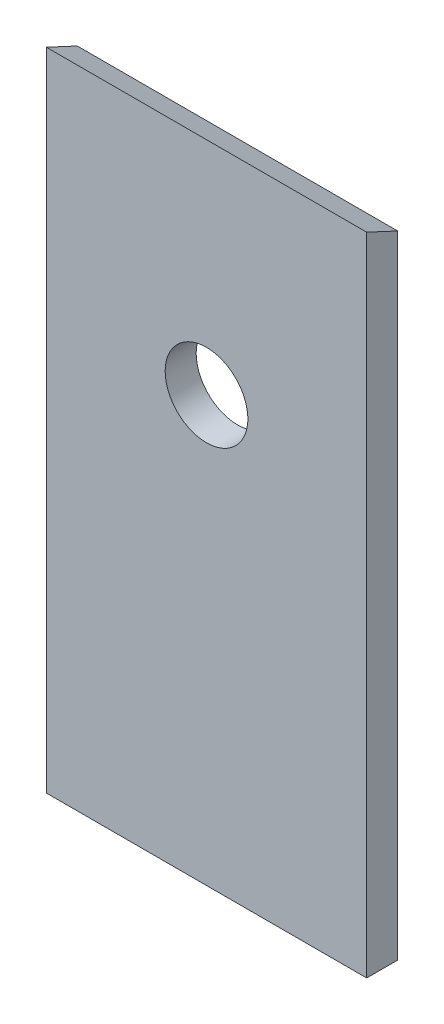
from build123d import *

# Parameters (mm, degrees)
BOSS_EXTRU_1_DEPTH      = 124
ESQUISSE2_R             = 16
ENL_V_MAT_EXTRU_1_DEPTH = 280.320604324


with BuildPart() as part:
    # Esquisse1 → Boss.-Extru.1 (new body)
    with BuildSketch(Plane(origin=(0, 0, 0), x_dir=(0, 0, -1), z_dir=(1, 0, 0))):
        Polygon((0, 0), (12, 0), (12, 244.404308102), (0, 250), align=None)
    extrude(amount=BOSS_EXTRU_1_DEPTH)

    # Esquisse2 → Enl_v. mat.-Extru.1 (cut, through all)
    with BuildSketch(Plane(origin=(0, 0, -12), x_dir=(-1, 0, 0), z_dir=(0, 0, -1))):
        with Locations((-62, 164.404308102)):
            Circle(ESQUISSE2_R)
    extrude(amount=-ENL_V_MAT_EXTRU_1_DEPTH, mode=Mode.SUBTRACT)


solid = part.part
